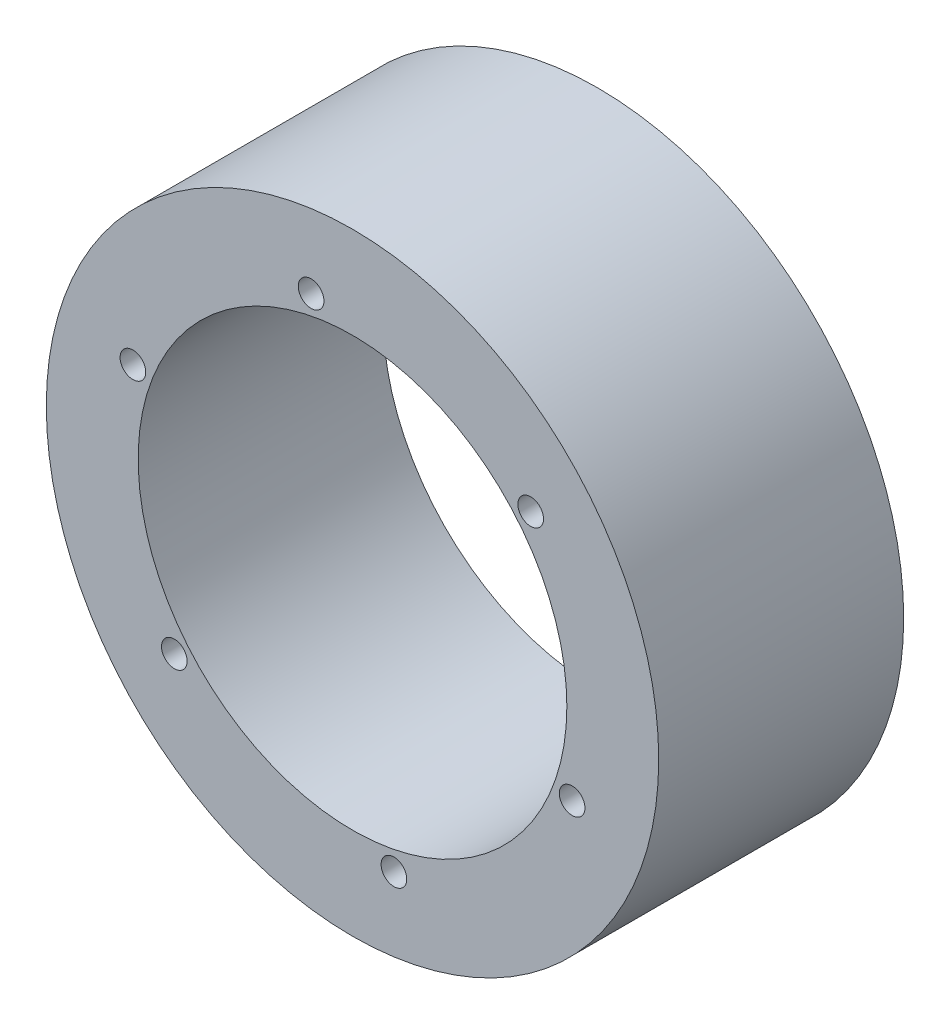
ISO-10303-21;
HEADER;
FILE_DESCRIPTION(('STEP AP214'),'2;1');
FILE_NAME('part.step','',(''),(''),'','','');
FILE_SCHEMA(('AUTOMOTIVE_DESIGN { 1 0 10303 214 1 1 1 1 }'));
ENDSEC;
DATA;
#1=APPLICATION_CONTEXT('core data for automotive mechanical design processes');
#2=APPLICATION_PROTOCOL_DEFINITION('international standard','automotive_design',2000,#1);
#3=PRODUCT_CONTEXT('',#1,'mechanical');
#4=PRODUCT('Part','Part','',(#3));
#5=PRODUCT_RELATED_PRODUCT_CATEGORY('part','',(#4));
#6=PRODUCT_DEFINITION_FORMATION('','',#4);
#7=PRODUCT_DEFINITION_CONTEXT('part definition',#1,'design');
#8=PRODUCT_DEFINITION('design','',#6,#7);
#9=PRODUCT_DEFINITION_SHAPE('','',#8);
#10=(LENGTH_UNIT() NAMED_UNIT(*) SI_UNIT(.MILLI.,.METRE.));
#11=(NAMED_UNIT(*) PLANE_ANGLE_UNIT() SI_UNIT($,.RADIAN.));
#12=(NAMED_UNIT(*) SI_UNIT($,.STERADIAN.) SOLID_ANGLE_UNIT());
#13=UNCERTAINTY_MEASURE_WITH_UNIT(LENGTH_MEASURE(1.E-05),#10,'distance_accuracy_value','');
#14=(GEOMETRIC_REPRESENTATION_CONTEXT(3) GLOBAL_UNCERTAINTY_ASSIGNED_CONTEXT((#13)) GLOBAL_UNIT_ASSIGNED_CONTEXT((#10,
#11,#12)) REPRESENTATION_CONTEXT('',''));
#15=CARTESIAN_POINT('',(0.,0.,0.));
#16=DIRECTION('',(0.,0.,1.));
#17=DIRECTION('',(1.,0.,0.));
#18=AXIS2_PLACEMENT_3D('',#15,#16,#17);
#19=CARTESIAN_POINT('',(58.1882113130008,49.2150616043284,40.));
#20=DIRECTION('',(0.,0.,1.));
#21=DIRECTION('',(1.,0.,0.));
#22=AXIS2_PLACEMENT_3D('',#19,#20,#21);
#23=CONICAL_SURFACE('',#22,4.18800000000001,1.02974425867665);
#24=CARTESIAN_POINT('',(58.1882113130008,49.2150616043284,40.));
#25=DIRECTION('',(0.,0.,1.));
#26=DIRECTION('',(1.,0.,0.));
#27=AXIS2_PLACEMENT_3D('',#24,#25,#26);
#28=CIRCLE('',#27,4.18800000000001);
#29=CARTESIAN_POINT('',(62.3762113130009,49.2150616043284,40.));
#30=VERTEX_POINT('',#29);
#31=EDGE_CURVE('E106',#30,#30,#28,.T.);
#32=ORIENTED_EDGE('',*,*,#31,.T.);
#33=EDGE_LOOP('',(#32));
#34=FACE_BOUND('',#33,.T.);
#35=CARTESIAN_POINT('',(58.1882113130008,49.2150616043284,37.4835957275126));
#36=VERTEX_POINT('',#35);
#37=VERTEX_LOOP('',#36);
#38=FACE_BOUND('',#37,.T.);
#39=ADVANCED_FACE('F16',(#34,#38),#23,.F.);
#40=CARTESIAN_POINT('',(71.715599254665,-25.7849383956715,40.));
#41=DIRECTION('',(0.,0.,1.));
#42=DIRECTION('',(0.,-1.,0.));
#43=AXIS2_PLACEMENT_3D('',#40,#41,#42);
#44=CONICAL_SURFACE('',#43,4.18800000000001,1.02974425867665);
#45=CARTESIAN_POINT('',(71.715599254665,-25.7849383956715,40.));
#46=DIRECTION('',(0.,0.,1.));
#47=DIRECTION('',(0.,-1.,0.));
#48=AXIS2_PLACEMENT_3D('',#45,#46,#47);
#49=CIRCLE('',#48,4.18799999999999);
#50=CARTESIAN_POINT('',(71.715599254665,-29.9729383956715,40.));
#51=VERTEX_POINT('',#50);
#52=EDGE_CURVE('E103',#51,#51,#49,.T.);
#53=ORIENTED_EDGE('',*,*,#52,.T.);
#54=EDGE_LOOP('',(#53));
#55=FACE_BOUND('',#54,.T.);
#56=CARTESIAN_POINT('',(71.715599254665,-25.7849383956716,37.4835957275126));
#57=VERTEX_POINT('',#56);
#58=VERTEX_LOOP('',#57);
#59=FACE_BOUND('',#58,.T.);
#60=ADVANCED_FACE('F46',(#55,#59),#44,.F.);
#61=CARTESIAN_POINT('',(13.5273879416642,-75.,40.));
#62=DIRECTION('',(0.,0.,1.));
#63=DIRECTION('',(1.,0.,0.));
#64=AXIS2_PLACEMENT_3D('',#61,#62,#63);
#65=CONICAL_SURFACE('',#64,4.188,1.02974425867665);
#66=CARTESIAN_POINT('',(13.5273879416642,-75.,40.));
#67=DIRECTION('',(0.,0.,1.));
#68=DIRECTION('',(0.,-1.,0.));
#69=AXIS2_PLACEMENT_3D('',#66,#67,#68);
#70=CIRCLE('',#69,4.188);
#71=CARTESIAN_POINT('',(13.5273879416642,-79.188,40.));
#72=VERTEX_POINT('',#71);
#73=EDGE_CURVE('E100',#72,#72,#70,.T.);
#74=ORIENTED_EDGE('',*,*,#73,.T.);
#75=EDGE_LOOP('',(#74));
#76=FACE_BOUND('',#75,.T.);
#77=CARTESIAN_POINT('',(13.5273879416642,-75.,37.4835957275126));
#78=VERTEX_POINT('',#77);
#79=VERTEX_LOOP('',#78);
#80=FACE_BOUND('',#79,.T.);
#81=ADVANCED_FACE('F52',(#76,#80),#65,.F.);
#82=CARTESIAN_POINT('',(-58.1882113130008,-49.2150616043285,40.));
#83=DIRECTION('',(0.,0.,1.));
#84=DIRECTION('',(1.,0.,0.));
#85=AXIS2_PLACEMENT_3D('',#82,#83,#84);
#86=CONICAL_SURFACE('',#85,4.18800000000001,1.02974425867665);
#87=CARTESIAN_POINT('',(-58.1882113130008,-49.2150616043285,40.));
#88=DIRECTION('',(0.,0.,1.));
#89=DIRECTION('',(1.,0.,0.));
#90=AXIS2_PLACEMENT_3D('',#87,#88,#89);
#91=CIRCLE('',#90,4.18799999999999);
#92=CARTESIAN_POINT('',(-54.0002113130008,-49.2150616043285,40.));
#93=VERTEX_POINT('',#92);
#94=EDGE_CURVE('E95',#93,#93,#91,.T.);
#95=ORIENTED_EDGE('',*,*,#94,.T.);
#96=EDGE_LOOP('',(#95));
#97=FACE_BOUND('',#96,.T.);
#98=CARTESIAN_POINT('',(-58.1882113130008,-49.2150616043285,37.4835957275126));
#99=VERTEX_POINT('',#98);
#100=VERTEX_LOOP('',#99);
#101=FACE_BOUND('',#100,.T.);
#102=ADVANCED_FACE('F170',(#97,#101),#86,.F.);
#103=CARTESIAN_POINT('',(-71.715599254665,25.7849383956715,40.));
#104=DIRECTION('',(0.,0.,1.));
#105=DIRECTION('',(0.,-1.,0.));
#106=AXIS2_PLACEMENT_3D('',#103,#104,#105);
#107=CONICAL_SURFACE('',#106,4.18800000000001,1.02974425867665);
#108=CARTESIAN_POINT('',(-71.715599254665,25.7849383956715,40.));
#109=DIRECTION('',(0.,0.,1.));
#110=DIRECTION('',(0.,-1.,0.));
#111=AXIS2_PLACEMENT_3D('',#108,#109,#110);
#112=CIRCLE('',#111,4.188);
#113=CARTESIAN_POINT('',(-71.715599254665,21.5969383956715,40.));
#114=VERTEX_POINT('',#113);
#115=EDGE_CURVE('E90',#114,#114,#112,.T.);
#116=ORIENTED_EDGE('',*,*,#115,.T.);
#117=EDGE_LOOP('',(#116));
#118=FACE_BOUND('',#117,.T.);
#119=CARTESIAN_POINT('',(-71.715599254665,25.7849383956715,37.4835957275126));
#120=VERTEX_POINT('',#119);
#121=VERTEX_LOOP('',#120);
#122=FACE_BOUND('',#121,.T.);
#123=ADVANCED_FACE('F143',(#118,#122),#107,.F.);
#124=CARTESIAN_POINT('',(-13.5273879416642,75.,40.));
#125=DIRECTION('',(0.,0.,1.));
#126=DIRECTION('',(0.,-1.,0.));
#127=AXIS2_PLACEMENT_3D('',#124,#125,#126);
#128=CONICAL_SURFACE('',#127,4.188,1.02974425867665);
#129=CARTESIAN_POINT('',(-13.5273879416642,75.,40.));
#130=DIRECTION('',(0.,0.,1.));
#131=DIRECTION('',(0.,-1.,0.));
#132=AXIS2_PLACEMENT_3D('',#129,#130,#131);
#133=CIRCLE('',#132,4.188);
#134=CARTESIAN_POINT('',(-13.5273879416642,70.812,40.));
#135=VERTEX_POINT('',#134);
#136=EDGE_CURVE('E86',#135,#135,#133,.T.);
#137=ORIENTED_EDGE('',*,*,#136,.T.);
#138=EDGE_LOOP('',(#137));
#139=FACE_BOUND('',#138,.T.);
#140=CARTESIAN_POINT('',(-13.5273879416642,75.,37.4835957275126));
#141=VERTEX_POINT('',#140);
#142=VERTEX_LOOP('',#141);
#143=FACE_BOUND('',#142,.T.);
#144=ADVANCED_FACE('F134',(#139,#143),#128,.F.);
#145=CARTESIAN_POINT('',(58.1882113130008,49.2150616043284,80.));
#146=DIRECTION('',(0.,0.,-1.));
#147=DIRECTION('',(-1.,0.,0.));
#148=AXIS2_PLACEMENT_3D('',#145,#146,#147);
#149=CYLINDRICAL_SURFACE('',#148,4.18800000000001);
#150=ORIENTED_EDGE('',*,*,#31,.F.);
#151=EDGE_LOOP('',(#150));
#152=FACE_BOUND('',#151,.T.);
#153=CARTESIAN_POINT('',(58.1882113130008,49.2150616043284,80.));
#154=DIRECTION('',(0.,0.,-1.));
#155=DIRECTION('',(-1.,0.,0.));
#156=AXIS2_PLACEMENT_3D('',#153,#154,#155);
#157=CIRCLE('',#156,4.18800000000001);
#158=CARTESIAN_POINT('',(54.0002113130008,49.2150616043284,80.));
#159=VERTEX_POINT('',#158);
#160=EDGE_CURVE('E85',#159,#159,#157,.F.);
#161=ORIENTED_EDGE('',*,*,#160,.T.);
#162=EDGE_LOOP('',(#161));
#163=FACE_BOUND('',#162,.T.);
#164=ADVANCED_FACE('F132',(#152,#163),#149,.F.);
#165=CARTESIAN_POINT('',(71.715599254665,-25.7849383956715,80.));
#166=DIRECTION('',(0.,0.,-1.));
#167=DIRECTION('',(0.,1.,0.));
#168=AXIS2_PLACEMENT_3D('',#165,#166,#167);
#169=CYLINDRICAL_SURFACE('',#168,4.18799999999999);
#170=ORIENTED_EDGE('',*,*,#52,.F.);
#171=EDGE_LOOP('',(#170));
#172=FACE_BOUND('',#171,.T.);
#173=CARTESIAN_POINT('',(71.715599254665,-25.7849383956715,80.));
#174=DIRECTION('',(0.,0.,-1.));
#175=DIRECTION('',(0.,1.,0.));
#176=AXIS2_PLACEMENT_3D('',#173,#174,#175);
#177=CIRCLE('',#176,4.18799999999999);
#178=CARTESIAN_POINT('',(71.715599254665,-21.5969383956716,80.));
#179=VERTEX_POINT('',#178);
#180=EDGE_CURVE('E88',#179,#179,#177,.F.);
#181=ORIENTED_EDGE('',*,*,#180,.T.);
#182=EDGE_LOOP('',(#181));
#183=FACE_BOUND('',#182,.T.);
#184=ADVANCED_FACE('F125',(#172,#183),#169,.F.);
#185=CARTESIAN_POINT('',(13.5273879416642,-75.,80.));
#186=DIRECTION('',(0.,0.,-1.));
#187=DIRECTION('',(0.,1.,0.));
#188=AXIS2_PLACEMENT_3D('',#185,#186,#187);
#189=CYLINDRICAL_SURFACE('',#188,4.188);
#190=ORIENTED_EDGE('',*,*,#73,.F.);
#191=EDGE_LOOP('',(#190));
#192=FACE_BOUND('',#191,.T.);
#193=CARTESIAN_POINT('',(13.5273879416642,-75.,80.));
#194=DIRECTION('',(0.,0.,-1.));
#195=DIRECTION('',(0.,1.,0.));
#196=AXIS2_PLACEMENT_3D('',#193,#194,#195);
#197=CIRCLE('',#196,4.188);
#198=CARTESIAN_POINT('',(13.5273879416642,-70.812,80.));
#199=VERTEX_POINT('',#198);
#200=EDGE_CURVE('E119',#199,#199,#197,.F.);
#201=ORIENTED_EDGE('',*,*,#200,.T.);
#202=EDGE_LOOP('',(#201));
#203=FACE_BOUND('',#202,.T.);
#204=ADVANCED_FACE('F139',(#192,#203),#189,.F.);
#205=CARTESIAN_POINT('',(-58.1882113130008,-49.2150616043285,80.));
#206=DIRECTION('',(0.,0.,-1.));
#207=DIRECTION('',(-1.,0.,0.));
#208=AXIS2_PLACEMENT_3D('',#205,#206,#207);
#209=CYLINDRICAL_SURFACE('',#208,4.18799999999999);
#210=ORIENTED_EDGE('',*,*,#94,.F.);
#211=EDGE_LOOP('',(#210));
#212=FACE_BOUND('',#211,.T.);
#213=CARTESIAN_POINT('',(-58.1882113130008,-49.2150616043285,80.));
#214=DIRECTION('',(0.,0.,-1.));
#215=DIRECTION('',(-1.,0.,0.));
#216=AXIS2_PLACEMENT_3D('',#213,#214,#215);
#217=CIRCLE('',#216,4.18799999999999);
#218=CARTESIAN_POINT('',(-62.3762113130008,-49.2150616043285,80.));
#219=VERTEX_POINT('',#218);
#220=EDGE_CURVE('E116',#219,#219,#217,.F.);
#221=ORIENTED_EDGE('',*,*,#220,.T.);
#222=EDGE_LOOP('',(#221));
#223=FACE_BOUND('',#222,.T.);
#224=ADVANCED_FACE('F150',(#212,#223),#209,.F.);
#225=CARTESIAN_POINT('',(-71.715599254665,25.7849383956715,80.));
#226=DIRECTION('',(0.,0.,-1.));
#227=DIRECTION('',(0.,1.,0.));
#228=AXIS2_PLACEMENT_3D('',#225,#226,#227);
#229=CYLINDRICAL_SURFACE('',#228,4.188);
#230=ORIENTED_EDGE('',*,*,#115,.F.);
#231=EDGE_LOOP('',(#230));
#232=FACE_BOUND('',#231,.T.);
#233=CARTESIAN_POINT('',(-71.715599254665,25.7849383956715,80.));
#234=DIRECTION('',(0.,0.,-1.));
#235=DIRECTION('',(0.,1.,0.));
#236=AXIS2_PLACEMENT_3D('',#233,#234,#235);
#237=CIRCLE('',#236,4.188);
#238=CARTESIAN_POINT('',(-71.715599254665,29.9729383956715,80.));
#239=VERTEX_POINT('',#238);
#240=EDGE_CURVE('E113',#239,#239,#237,.F.);
#241=ORIENTED_EDGE('',*,*,#240,.T.);
#242=EDGE_LOOP('',(#241));
#243=FACE_BOUND('',#242,.T.);
#244=ADVANCED_FACE('F77',(#232,#243),#229,.F.);
#245=CARTESIAN_POINT('',(-13.5273879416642,75.,80.));
#246=DIRECTION('',(0.,0.,-1.));
#247=DIRECTION('',(0.,1.,0.));
#248=AXIS2_PLACEMENT_3D('',#245,#246,#247);
#249=CYLINDRICAL_SURFACE('',#248,4.188);
#250=ORIENTED_EDGE('',*,*,#136,.F.);
#251=EDGE_LOOP('',(#250));
#252=FACE_BOUND('',#251,.T.);
#253=CARTESIAN_POINT('',(-13.5273879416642,75.,80.));
#254=DIRECTION('',(0.,0.,-1.));
#255=DIRECTION('',(0.,1.,0.));
#256=AXIS2_PLACEMENT_3D('',#253,#254,#255);
#257=CIRCLE('',#256,4.188);
#258=CARTESIAN_POINT('',(-13.5273879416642,79.188,80.));
#259=VERTEX_POINT('',#258);
#260=EDGE_CURVE('E110',#259,#259,#257,.F.);
#261=ORIENTED_EDGE('',*,*,#260,.T.);
#262=EDGE_LOOP('',(#261));
#263=FACE_BOUND('',#262,.T.);
#264=ADVANCED_FACE('F18',(#252,#263),#249,.F.);
#265=CARTESIAN_POINT('',(0.,0.,0.));
#266=DIRECTION('',(0.,0.,1.));
#267=DIRECTION('',(1.,0.,0.));
#268=AXIS2_PLACEMENT_3D('',#265,#266,#267);
#269=CYLINDRICAL_SURFACE('',#268,70.);
#270=CARTESIAN_POINT('',(0.,0.,80.));
#271=DIRECTION('',(0.,0.,1.));
#272=DIRECTION('',(1.,0.,0.));
#273=AXIS2_PLACEMENT_3D('',#270,#271,#272);
#274=CIRCLE('',#273,70.);
#275=CARTESIAN_POINT('',(70.,0.,80.));
#276=VERTEX_POINT('',#275);
#277=EDGE_CURVE('E82',#276,#276,#274,.T.);
#278=ORIENTED_EDGE('',*,*,#277,.T.);
#279=EDGE_LOOP('',(#278));
#280=FACE_BOUND('',#279,.T.);
#281=CARTESIAN_POINT('',(0.,0.,0.));
#282=DIRECTION('',(0.,0.,1.));
#283=DIRECTION('',(1.,0.,0.));
#284=AXIS2_PLACEMENT_3D('',#281,#282,#283);
#285=CIRCLE('',#284,70.);
#286=CARTESIAN_POINT('',(70.,0.,0.));
#287=VERTEX_POINT('',#286);
#288=EDGE_CURVE('E20',#287,#287,#285,.T.);
#289=ORIENTED_EDGE('',*,*,#288,.F.);
#290=EDGE_LOOP('',(#289));
#291=FACE_BOUND('',#290,.T.);
#292=ADVANCED_FACE('F71',(#280,#291),#269,.F.);
#293=CARTESIAN_POINT('',(0.,0.,0.));
#294=DIRECTION('',(0.,0.,-1.));
#295=DIRECTION('',(-1.,0.,0.));
#296=AXIS2_PLACEMENT_3D('',#293,#294,#295);
#297=PLANE('',#296);
#298=ORIENTED_EDGE('',*,*,#288,.T.);
#299=EDGE_LOOP('',(#298));
#300=FACE_BOUND('',#299,.T.);
#301=CARTESIAN_POINT('',(0.,0.,0.));
#302=DIRECTION('',(0.,0.,1.));
#303=DIRECTION('',(1.,0.,0.));
#304=AXIS2_PLACEMENT_3D('',#301,#302,#303);
#305=CIRCLE('',#304,100.);
#306=CARTESIAN_POINT('',(100.,0.,0.));
#307=VERTEX_POINT('',#306);
#308=EDGE_CURVE('E26',#307,#307,#305,.T.);
#309=ORIENTED_EDGE('',*,*,#308,.F.);
#310=EDGE_LOOP('',(#309));
#311=FACE_BOUND('',#310,.T.);
#312=ADVANCED_FACE('F63',(#300,#311),#297,.T.);
#313=CARTESIAN_POINT('',(0.,0.,80.));
#314=DIRECTION('',(0.,0.,-1.));
#315=DIRECTION('',(-1.,0.,0.));
#316=AXIS2_PLACEMENT_3D('',#313,#314,#315);
#317=PLANE('',#316);
#318=ORIENTED_EDGE('',*,*,#277,.F.);
#319=EDGE_LOOP('',(#318));
#320=FACE_BOUND('',#319,.T.);
#321=ORIENTED_EDGE('',*,*,#260,.F.);
#322=EDGE_LOOP('',(#321));
#323=FACE_BOUND('',#322,.T.);
#324=ORIENTED_EDGE('',*,*,#240,.F.);
#325=EDGE_LOOP('',(#324));
#326=FACE_BOUND('',#325,.T.);
#327=ORIENTED_EDGE('',*,*,#220,.F.);
#328=EDGE_LOOP('',(#327));
#329=FACE_BOUND('',#328,.T.);
#330=ORIENTED_EDGE('',*,*,#200,.F.);
#331=EDGE_LOOP('',(#330));
#332=FACE_BOUND('',#331,.T.);
#333=ORIENTED_EDGE('',*,*,#180,.F.);
#334=EDGE_LOOP('',(#333));
#335=FACE_BOUND('',#334,.T.);
#336=ORIENTED_EDGE('',*,*,#160,.F.);
#337=EDGE_LOOP('',(#336));
#338=FACE_BOUND('',#337,.T.);
#339=CARTESIAN_POINT('',(0.,0.,80.));
#340=DIRECTION('',(0.,0.,1.));
#341=DIRECTION('',(1.,0.,0.));
#342=AXIS2_PLACEMENT_3D('',#339,#340,#341);
#343=CIRCLE('',#342,100.);
#344=CARTESIAN_POINT('',(100.,0.,80.));
#345=VERTEX_POINT('',#344);
#346=EDGE_CURVE('E10',#345,#345,#343,.F.);
#347=ORIENTED_EDGE('',*,*,#346,.F.);
#348=EDGE_LOOP('',(#347));
#349=FACE_BOUND('',#348,.T.);
#350=ADVANCED_FACE('F59',(#320,#323,#326,#329,#332,#335,#338,#349),#317,.F.);
#351=CARTESIAN_POINT('',(0.,0.,0.));
#352=DIRECTION('',(0.,0.,1.));
#353=DIRECTION('',(1.,0.,0.));
#354=AXIS2_PLACEMENT_3D('',#351,#352,#353);
#355=CYLINDRICAL_SURFACE('',#354,100.);
#356=ORIENTED_EDGE('',*,*,#308,.T.);
#357=EDGE_LOOP('',(#356));
#358=FACE_BOUND('',#357,.T.);
#359=ORIENTED_EDGE('',*,*,#346,.T.);
#360=EDGE_LOOP('',(#359));
#361=FACE_BOUND('',#360,.T.);
#362=ADVANCED_FACE('F57',(#358,#361),#355,.T.);
#363=CLOSED_SHELL('',(#39,#60,#81,#102,#123,#144,#164,#184,#204,#224,#244,#264,#292,#312,#350,#362));
#364=MANIFOLD_SOLID_BREP('B1',#363);
#365=ADVANCED_BREP_SHAPE_REPRESENTATION('',(#18,#364),#14);
#366=SHAPE_DEFINITION_REPRESENTATION(#9,#365);
ENDSEC;
END-ISO-10303-21;
